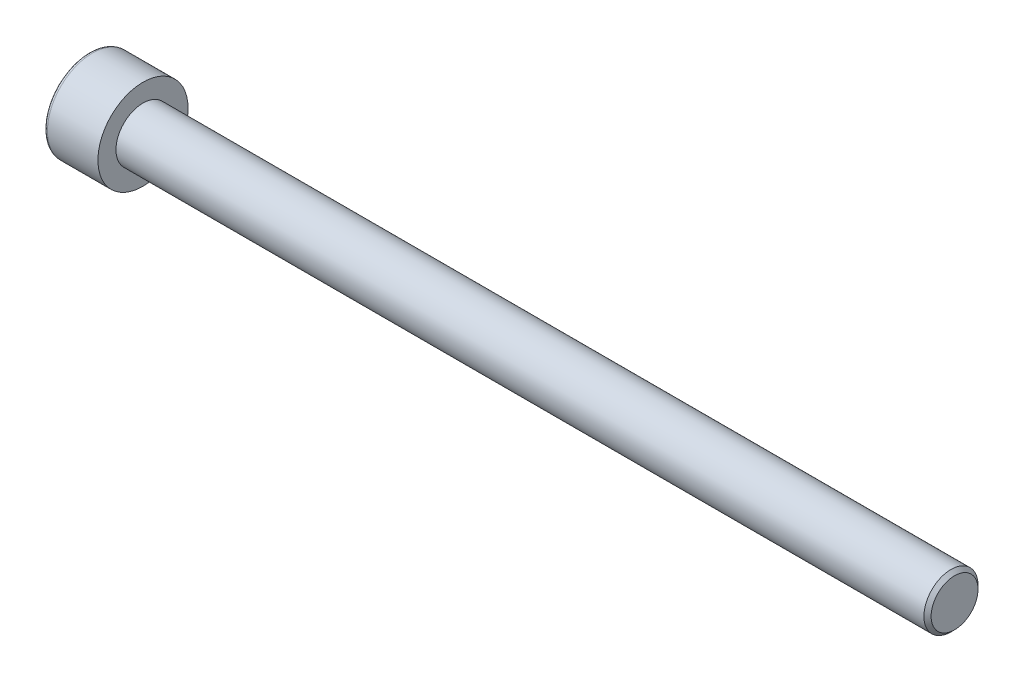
ISO-10303-21;
HEADER;
FILE_DESCRIPTION(('STEP AP214'),'2;1');
FILE_NAME('part.step','',(''),(''),'','','');
FILE_SCHEMA(('AUTOMOTIVE_DESIGN { 1 0 10303 214 1 1 1 1 }'));
ENDSEC;
DATA;
#1=APPLICATION_CONTEXT('core data for automotive mechanical design processes');
#2=APPLICATION_PROTOCOL_DEFINITION('international standard','automotive_design',2000,#1);
#3=PRODUCT_CONTEXT('',#1,'mechanical');
#4=PRODUCT('Part','Part','',(#3));
#5=PRODUCT_RELATED_PRODUCT_CATEGORY('part','',(#4));
#6=PRODUCT_DEFINITION_FORMATION('','',#4);
#7=PRODUCT_DEFINITION_CONTEXT('part definition',#1,'design');
#8=PRODUCT_DEFINITION('design','',#6,#7);
#9=PRODUCT_DEFINITION_SHAPE('','',#8);
#10=(LENGTH_UNIT() NAMED_UNIT(*) SI_UNIT(.MILLI.,.METRE.));
#11=(NAMED_UNIT(*) PLANE_ANGLE_UNIT() SI_UNIT($,.RADIAN.));
#12=(NAMED_UNIT(*) SI_UNIT($,.STERADIAN.) SOLID_ANGLE_UNIT());
#13=UNCERTAINTY_MEASURE_WITH_UNIT(LENGTH_MEASURE(1.E-05),#10,'distance_accuracy_value','');
#14=(GEOMETRIC_REPRESENTATION_CONTEXT(3) GLOBAL_UNCERTAINTY_ASSIGNED_CONTEXT((#13)) GLOBAL_UNIT_ASSIGNED_CONTEXT((#10,
#11,#12)) REPRESENTATION_CONTEXT('',''));
#15=CARTESIAN_POINT('',(0.,0.,0.));
#16=DIRECTION('',(0.,0.,1.));
#17=DIRECTION('',(1.,0.,0.));
#18=AXIS2_PLACEMENT_3D('',#15,#16,#17);
#19=CARTESIAN_POINT('',(0.,0.,0.));
#20=DIRECTION('',(1.,0.,0.));
#21=DIRECTION('',(0.,0.,-1.));
#22=AXIS2_PLACEMENT_3D('',#19,#20,#21);
#23=PLANE('',#22);
#24=CARTESIAN_POINT('',(0.,0.,0.));
#25=DIRECTION('',(1.,0.,0.));
#26=DIRECTION('',(0.,0.,-1.));
#27=AXIS2_PLACEMENT_3D('',#24,#25,#26);
#28=CIRCLE('',#27,5.);
#29=CARTESIAN_POINT('',(0.,0.,-5.));
#30=VERTEX_POINT('',#29);
#31=EDGE_CURVE('E225',#30,#30,#28,.T.);
#32=ORIENTED_EDGE('',*,*,#31,.T.);
#33=EDGE_LOOP('',(#32));
#34=FACE_BOUND('',#33,.T.);
#35=CARTESIAN_POINT('',(0.,0.,0.));
#36=DIRECTION('',(1.,0.,0.));
#37=DIRECTION('',(0.,0.,-1.));
#38=AXIS2_PLACEMENT_3D('',#35,#36,#37);
#39=CIRCLE('',#38,3.);
#40=CARTESIAN_POINT('',(0.,0.,-3.));
#41=VERTEX_POINT('',#40);
#42=EDGE_CURVE('E222',#41,#41,#39,.T.);
#43=ORIENTED_EDGE('',*,*,#42,.F.);
#44=EDGE_LOOP('',(#43));
#45=FACE_BOUND('',#44,.T.);
#46=ADVANCED_FACE('F17',(#34,#45),#23,.T.);
#47=CARTESIAN_POINT('',(-6.,0.,0.));
#48=DIRECTION('',(1.,0.,0.));
#49=DIRECTION('',(0.,0.,-1.));
#50=AXIS2_PLACEMENT_3D('',#47,#48,#49);
#51=CYLINDRICAL_SURFACE('',#50,5.);
#52=CARTESIAN_POINT('',(-5.6,0.,0.));
#53=DIRECTION('',(1.,0.,0.));
#54=DIRECTION('',(0.,0.,-1.));
#55=AXIS2_PLACEMENT_3D('',#52,#53,#54);
#56=CIRCLE('',#55,5.);
#57=CARTESIAN_POINT('',(-5.6,0.,-5.));
#58=VERTEX_POINT('',#57);
#59=EDGE_CURVE('E233',#58,#58,#56,.T.);
#60=ORIENTED_EDGE('',*,*,#59,.T.);
#61=EDGE_LOOP('',(#60));
#62=FACE_BOUND('',#61,.T.);
#63=ORIENTED_EDGE('',*,*,#31,.F.);
#64=EDGE_LOOP('',(#63));
#65=FACE_BOUND('',#64,.T.);
#66=ADVANCED_FACE('F19',(#62,#65),#51,.T.);
#67=CARTESIAN_POINT('',(-6.,0.,0.));
#68=DIRECTION('',(1.,0.,0.));
#69=DIRECTION('',(0.,0.,-1.));
#70=AXIS2_PLACEMENT_3D('',#67,#68,#69);
#71=PLANE('',#70);
#72=CARTESIAN_POINT('',(-6.,0.,0.));
#73=DIRECTION('',(1.,0.,0.));
#74=DIRECTION('',(0.,0.,-1.));
#75=AXIS2_PLACEMENT_3D('',#72,#73,#74);
#76=CIRCLE('',#75,4.6);
#77=CARTESIAN_POINT('',(-6.,0.,-4.6));
#78=VERTEX_POINT('',#77);
#79=EDGE_CURVE('E30',#78,#78,#76,.F.);
#80=ORIENTED_EDGE('',*,*,#79,.T.);
#81=EDGE_LOOP('',(#80));
#82=FACE_BOUND('',#81,.T.);
#83=CARTESIAN_POINT('',(-6.,0.,0.));
#84=DIRECTION('',(-1.,0.,0.));
#85=DIRECTION('',(0.,0.,1.));
#86=AXIS2_PLACEMENT_3D('',#83,#84,#85);
#87=CIRCLE('',#86,2.88675134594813);
#88=CARTESIAN_POINT('',(-6.,1.44337567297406,-2.5));
#89=VERTEX_POINT('',#88);
#90=CARTESIAN_POINT('',(-6.,-1.44337567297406,-2.5));
#91=VERTEX_POINT('',#90);
#92=EDGE_CURVE('E186',#89,#91,#87,.T.);
#93=ORIENTED_EDGE('',*,*,#92,.F.);
#94=CARTESIAN_POINT('',(-6.,2.88675134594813,0.));
#95=VERTEX_POINT('',#94);
#96=EDGE_CURVE('E91',#95,#89,#87,.T.);
#97=ORIENTED_EDGE('',*,*,#96,.F.);
#98=CARTESIAN_POINT('',(-6.,1.44337567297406,2.5));
#99=VERTEX_POINT('',#98);
#100=EDGE_CURVE('E36',#99,#95,#87,.T.);
#101=ORIENTED_EDGE('',*,*,#100,.F.);
#102=CARTESIAN_POINT('',(-6.,-1.44337567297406,2.5));
#103=VERTEX_POINT('',#102);
#104=EDGE_CURVE('E43',#103,#99,#87,.T.);
#105=ORIENTED_EDGE('',*,*,#104,.F.);
#106=CARTESIAN_POINT('',(-6.,-2.88675134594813,0.));
#107=VERTEX_POINT('',#106);
#108=EDGE_CURVE('E87',#107,#103,#87,.T.);
#109=ORIENTED_EDGE('',*,*,#108,.F.);
#110=EDGE_CURVE('E189',#91,#107,#87,.T.);
#111=ORIENTED_EDGE('',*,*,#110,.F.);
#112=EDGE_LOOP('',(#93,#97,#101,#105,#109,#111));
#113=FACE_BOUND('',#112,.T.);
#114=ADVANCED_FACE('F165',(#82,#113),#71,.F.);
#115=CARTESIAN_POINT('',(90.,0.,0.));
#116=DIRECTION('',(-1.,0.,0.));
#117=DIRECTION('',(0.,0.,1.));
#118=AXIS2_PLACEMENT_3D('',#115,#116,#117);
#119=CYLINDRICAL_SURFACE('',#118,3.);
#120=CARTESIAN_POINT('',(89.6,0.,0.));
#121=DIRECTION('',(1.,0.,0.));
#122=DIRECTION('',(0.,0.,-1.));
#123=AXIS2_PLACEMENT_3D('',#120,#121,#122);
#124=CIRCLE('',#123,3.);
#125=CARTESIAN_POINT('',(89.6,0.,-3.));
#126=VERTEX_POINT('',#125);
#127=EDGE_CURVE('E230',#126,#126,#124,.F.);
#128=ORIENTED_EDGE('',*,*,#127,.T.);
#129=EDGE_LOOP('',(#128));
#130=FACE_BOUND('',#129,.T.);
#131=ORIENTED_EDGE('',*,*,#42,.T.);
#132=EDGE_LOOP('',(#131));
#133=FACE_BOUND('',#132,.T.);
#134=ADVANCED_FACE('F170',(#130,#133),#119,.T.);
#135=CARTESIAN_POINT('',(90.,0.,0.));
#136=DIRECTION('',(1.,0.,0.));
#137=DIRECTION('',(0.,0.,-1.));
#138=AXIS2_PLACEMENT_3D('',#135,#136,#137);
#139=PLANE('',#138);
#140=CARTESIAN_POINT('',(90.,0.,0.));
#141=DIRECTION('',(1.,0.,0.));
#142=DIRECTION('',(0.,0.,-1.));
#143=AXIS2_PLACEMENT_3D('',#140,#141,#142);
#144=CIRCLE('',#143,2.6);
#145=CARTESIAN_POINT('',(90.,0.,-2.6));
#146=VERTEX_POINT('',#145);
#147=EDGE_CURVE('E227',#146,#146,#144,.T.);
#148=ORIENTED_EDGE('',*,*,#147,.T.);
#149=EDGE_LOOP('',(#148));
#150=FACE_BOUND('',#149,.T.);
#151=ADVANCED_FACE('F177',(#150),#139,.T.);
#152=CARTESIAN_POINT('',(90.,0.,0.));
#153=DIRECTION('',(-1.,0.,0.));
#154=DIRECTION('',(0.,0.,1.));
#155=AXIS2_PLACEMENT_3D('',#152,#153,#154);
#156=CONICAL_SURFACE('',#155,2.6,0.785398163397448);
#157=ORIENTED_EDGE('',*,*,#127,.F.);
#158=EDGE_LOOP('',(#157));
#159=FACE_BOUND('',#158,.T.);
#160=ORIENTED_EDGE('',*,*,#147,.F.);
#161=EDGE_LOOP('',(#160));
#162=FACE_BOUND('',#161,.T.);
#163=ADVANCED_FACE('F239',(#159,#162),#156,.T.);
#164=CARTESIAN_POINT('',(-5.6,0.,0.));
#165=DIRECTION('',(1.,0.,0.));
#166=DIRECTION('',(0.,0.,-1.));
#167=AXIS2_PLACEMENT_3D('',#164,#165,#166);
#168=TOROIDAL_SURFACE('',#167,4.6,0.4);
#169=ORIENTED_EDGE('',*,*,#79,.F.);
#170=EDGE_LOOP('',(#169));
#171=FACE_BOUND('',#170,.T.);
#172=ORIENTED_EDGE('',*,*,#59,.F.);
#173=EDGE_LOOP('',(#172));
#174=FACE_BOUND('',#173,.T.);
#175=ADVANCED_FACE('F115',(#171,#174),#168,.T.);
#176=CARTESIAN_POINT('',(-6.,0.,0.));
#177=DIRECTION('',(-1.,0.,0.));
#178=DIRECTION('',(0.,0.,1.));
#179=AXIS2_PLACEMENT_3D('',#176,#177,#178);
#180=CONICAL_SURFACE('',#179,2.88675134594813,0.785398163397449);
#181=ORIENTED_EDGE('',*,*,#92,.T.);
#182=CARTESIAN_POINT('',(-6.84474007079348,-2.77020363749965,-2.5));
#183=CARTESIAN_POINT('',(-6.79429722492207,-2.70224105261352,-2.5));
#184=CARTESIAN_POINT('',(-6.74437428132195,-2.63388631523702,-2.5));
#185=CARTESIAN_POINT('',(-6.6457965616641,-2.49624219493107,-2.5));
#186=CARTESIAN_POINT('',(-6.59714212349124,-2.42695257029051,-2.5));
#187=CARTESIAN_POINT('',(-6.50098521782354,-2.28678261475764,-2.5));
#188=CARTESIAN_POINT('',(-6.45349461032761,-2.21589411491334,-2.5));
#189=CARTESIAN_POINT('',(-6.36039504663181,-2.07289801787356,-2.5));
#190=CARTESIAN_POINT('',(-6.31478595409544,-2.00079050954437,-2.5));
#191=CARTESIAN_POINT('',(-6.22353453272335,-1.85136748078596,-2.5));
#192=CARTESIAN_POINT('',(-6.17801448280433,-1.77397645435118,-2.5));
#193=CARTESIAN_POINT('',(-6.09013743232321,-1.61742301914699,-2.5));
#194=CARTESIAN_POINT('',(-6.04778097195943,-1.53826031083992,-2.5));
#195=CARTESIAN_POINT('',(-5.92683684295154,-1.29823189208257,-2.5));
#196=CARTESIAN_POINT('',(-5.85401661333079,-1.1342610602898,-2.5));
#197=CARTESIAN_POINT('',(-5.76496495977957,-0.887111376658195,-2.5));
#198=CARTESIAN_POINT('',(-5.73923498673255,-0.807344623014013,-2.5));
#199=CARTESIAN_POINT('',(-5.69419468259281,-0.645977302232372,-2.5));
#200=CARTESIAN_POINT('',(-5.67488482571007,-0.564376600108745,-2.5));
#201=CARTESIAN_POINT('',(-5.64398238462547,-0.401145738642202,-2.5));
#202=CARTESIAN_POINT('',(-5.63226395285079,-0.319539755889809,-2.5));
#203=CARTESIAN_POINT('',(-5.61675591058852,-0.155573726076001,-2.5));
#204=CARTESIAN_POINT('',(-5.61296514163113,-0.0732137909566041,-2.5));
#205=CARTESIAN_POINT('',(-5.61355627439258,0.0889406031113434,-2.5));
#206=CARTESIAN_POINT('',(-5.61769048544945,0.168736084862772,-2.5));
#207=CARTESIAN_POINT('',(-5.63338028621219,0.327588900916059,-2.5));
#208=CARTESIAN_POINT('',(-5.64493662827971,0.406646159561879,-2.5));
#209=CARTESIAN_POINT('',(-5.67505484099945,0.564788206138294,-2.5));
#210=CARTESIAN_POINT('',(-5.69373233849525,0.643850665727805,-2.5));
#211=CARTESIAN_POINT('',(-5.73713308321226,0.800257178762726,-2.5));
#212=CARTESIAN_POINT('',(-5.76185569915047,0.877601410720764,-2.5));
#213=CARTESIAN_POINT('',(-5.8505231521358,1.12635295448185,-2.5));
#214=CARTESIAN_POINT('',(-5.92477831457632,1.29410071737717,-2.5));
#215=CARTESIAN_POINT('',(-6.04840793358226,1.53952732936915,-2.5));
#216=CARTESIAN_POINT('',(-6.09175812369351,1.62045951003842,-2.5));
#217=CARTESIAN_POINT('',(-6.18175198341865,1.78047621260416,-2.5));
#218=CARTESIAN_POINT('',(-6.22839504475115,1.85956107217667,-2.5));
#219=CARTESIAN_POINT('',(-6.32189053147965,2.0121708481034,-2.5));
#220=CARTESIAN_POINT('',(-6.3686145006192,2.0857753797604,-2.5));
#221=CARTESIAN_POINT('',(-6.46400118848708,2.23172390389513,-2.5));
#222=CARTESIAN_POINT('',(-6.51266405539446,2.3040677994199,-2.5));
#223=CARTESIAN_POINT('',(-6.61117183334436,2.44706675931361,-2.5));
#224=CARTESIAN_POINT('',(-6.66100374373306,2.51773081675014,-2.5));
#225=CARTESIAN_POINT('',(-6.76196495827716,2.6580976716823,-2.5));
#226=CARTESIAN_POINT('',(-6.81309390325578,2.72780072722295,-2.5));
#227=CARTESIAN_POINT('',(-6.86475257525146,2.79710237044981,-2.5));
#228=B_SPLINE_CURVE_WITH_KNOTS('',3,(#182,#183,#184,#185,#186,#187,#188,#189,#190,#191,#192,
#193,#194,#195,#196,#197,#198,#199,#200,#201,#202,#203,#204,#205,#206,#207,#208,#209,#210,#211,
#212,#213,#214,#215,#216,#217,#218,#219,#220,#221,#222,#223,#224,#225,#226,#227),.UNSPECIFIED.,
.F.,.F.,(4,2,2,2,2,2,2,2,2,2,2,2,2,2,2,2,2,2,2,2,2,2,4),(0.,0.253915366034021,0.507897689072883,
0.763849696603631,1.01978312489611,1.28906200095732,1.55838675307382,2.09503555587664,
2.34626885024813,2.59752069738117,2.84449291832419,3.09142904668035,3.33077296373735,
3.57014114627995,3.81357397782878,4.0569813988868,4.60559640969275,4.88100918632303,
5.15637121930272,5.41788736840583,5.67942354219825,5.93881039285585,6.19812618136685),.UNSPECIFIED.);
#229=EDGE_CURVE('E11',#89,#91,#228,.F.);
#230=ORIENTED_EDGE('',*,*,#229,.F.);
#231=EDGE_LOOP('',(#181,#230));
#232=FACE_BOUND('',#231,.T.);
#233=ADVANCED_FACE('F113',(#232),#180,.F.);
#234=ORIENTED_EDGE('',*,*,#110,.T.);
#235=CARTESIAN_POINT('',(-6.00011547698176,-1.44326020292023,-2.5002));
#236=CARTESIAN_POINT('',(-5.95054070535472,-1.49287669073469,-2.41426172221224));
#237=CARTESIAN_POINT('',(-5.9038774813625,-1.5433228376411,-2.32688643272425));
#238=CARTESIAN_POINT('',(-5.8184381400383,-1.64618811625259,-2.14871854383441));
#239=CARTESIAN_POINT('',(-5.779709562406,-1.6986170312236,-2.05790899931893));
#240=CARTESIAN_POINT('',(-5.71336670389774,-1.80433744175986,-1.87479587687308));
#241=CARTESIAN_POINT('',(-5.68558566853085,-1.85760201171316,-1.78253893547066));
#242=CARTESIAN_POINT('',(-5.64278317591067,-1.96530378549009,-1.59599399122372));
#243=CARTESIAN_POINT('',(-5.62772976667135,-2.01973769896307,-1.50171168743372));
#244=CARTESIAN_POINT('',(-5.61414772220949,-2.11355131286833,-1.33922174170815));
#245=CARTESIAN_POINT('',(-5.6121370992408,-2.15280980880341,-1.27122403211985));
#246=CARTESIAN_POINT('',(-5.61552411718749,-2.23126263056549,-1.13533975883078));
#247=CARTESIAN_POINT('',(-5.62092435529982,-2.27045692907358,-1.06745324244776));
#248=CARTESIAN_POINT('',(-5.63882578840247,-2.34847544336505,-0.932321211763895));
#249=CARTESIAN_POINT('',(-5.65133492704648,-2.38729919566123,-0.865076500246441));
#250=CARTESIAN_POINT('',(-5.68276750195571,-2.46427534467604,-0.731749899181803));
#251=CARTESIAN_POINT('',(-5.70169044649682,-2.50242779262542,-0.665667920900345));
#252=CARTESIAN_POINT('',(-5.75786736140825,-2.60015256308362,-0.496403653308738));
#253=CARTESIAN_POINT('',(-5.79935583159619,-2.65911894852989,-0.394270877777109));
#254=CARTESIAN_POINT('',(-5.86939404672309,-2.74582384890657,-0.244093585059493));
#255=CARTESIAN_POINT('',(-5.89400225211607,-2.77439698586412,-0.194603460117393));
#256=CARTESIAN_POINT('',(-5.94546188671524,-2.83101398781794,-0.0965399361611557));
#257=CARTESIAN_POINT('',(-5.97231193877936,-2.85905816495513,-0.0479659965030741));
#258=CARTESIAN_POINT('',(-6.00011547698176,-2.88686681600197,0.000199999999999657));
#259=B_SPLINE_CURVE_WITH_KNOTS('',3,(#235,#236,#237,#238,#239,#240,#241,#242,#243,#244,#245,
#246,#247,#248,#249,#250,#251,#252,#253,#254,#255,#256,#257,#258),.UNSPECIFIED.,.F.,.F.,(4,2,2,
2,2,2,2,2,2,2,2,4),(0.,0.333012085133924,0.667964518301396,0.997597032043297,1.32639954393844,
1.56169424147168,1.79707142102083,2.0327121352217,2.2683347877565,2.64260240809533,
2.82922877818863,3.01574133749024),.UNSPECIFIED.);
#260=EDGE_CURVE('E90',#91,#107,#259,.T.);
#261=ORIENTED_EDGE('',*,*,#260,.F.);
#262=EDGE_LOOP('',(#234,#261));
#263=FACE_BOUND('',#262,.T.);
#264=ADVANCED_FACE('F244',(#263),#180,.F.);
#265=ORIENTED_EDGE('',*,*,#108,.T.);
#266=CARTESIAN_POINT('',(-6.00011547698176,-2.88686681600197,-0.000199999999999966));
#267=CARTESIAN_POINT('',(-5.95054070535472,-2.83725032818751,0.0857382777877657));
#268=CARTESIAN_POINT('',(-5.9038774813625,-2.78680418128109,0.173113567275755));
#269=CARTESIAN_POINT('',(-5.8184381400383,-2.6839389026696,0.35128145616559));
#270=CARTESIAN_POINT('',(-5.779709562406,-2.6315099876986,0.442091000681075));
#271=CARTESIAN_POINT('',(-5.71336670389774,-2.52578957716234,0.62520412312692));
#272=CARTESIAN_POINT('',(-5.68558566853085,-2.47252500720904,0.717461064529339));
#273=CARTESIAN_POINT('',(-5.64278317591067,-2.3648232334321,0.904006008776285));
#274=CARTESIAN_POINT('',(-5.62772976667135,-2.31038931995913,0.998288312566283));
#275=CARTESIAN_POINT('',(-5.61414772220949,-2.21657570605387,1.16077825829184));
#276=CARTESIAN_POINT('',(-5.6121370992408,-2.17731721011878,1.22877596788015));
#277=CARTESIAN_POINT('',(-5.61552411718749,-2.0988643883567,1.36466024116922));
#278=CARTESIAN_POINT('',(-5.62092435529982,-2.05967008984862,1.43254675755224));
#279=CARTESIAN_POINT('',(-5.63882578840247,-1.98165157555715,1.5676787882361));
#280=CARTESIAN_POINT('',(-5.65133492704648,-1.94282782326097,1.63492349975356));
#281=CARTESIAN_POINT('',(-5.68276750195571,-1.86585167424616,1.7682501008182));
#282=CARTESIAN_POINT('',(-5.70169044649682,-1.82769922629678,1.83433207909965));
#283=CARTESIAN_POINT('',(-5.75786736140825,-1.72997445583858,2.00359634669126));
#284=CARTESIAN_POINT('',(-5.79935583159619,-1.67100807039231,2.10572912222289));
#285=CARTESIAN_POINT('',(-5.86939404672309,-1.58430317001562,2.25590641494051));
#286=CARTESIAN_POINT('',(-5.89400225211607,-1.55573003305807,2.30539653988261));
#287=CARTESIAN_POINT('',(-5.94546188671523,-1.49911303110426,2.40346006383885));
#288=CARTESIAN_POINT('',(-5.97231193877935,-1.47106885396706,2.45203400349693));
#289=CARTESIAN_POINT('',(-6.00011547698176,-1.44326020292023,2.5002));
#290=B_SPLINE_CURVE_WITH_KNOTS('',3,(#266,#267,#268,#269,#270,#271,#272,#273,#274,#275,#276,
#277,#278,#279,#280,#281,#282,#283,#284,#285,#286,#287,#288,#289),.UNSPECIFIED.,.F.,.F.,(4,2,2,
2,2,2,2,2,2,2,2,4),(0.,0.333012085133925,0.667964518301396,0.997597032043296,1.32639954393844,
1.56169424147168,1.79707142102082,2.0327121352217,2.2683347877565,2.64260240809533,
2.82922877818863,3.01574133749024),.UNSPECIFIED.);
#291=EDGE_CURVE('E98',#107,#103,#290,.T.);
#292=ORIENTED_EDGE('',*,*,#291,.F.);
#293=EDGE_LOOP('',(#265,#292));
#294=FACE_BOUND('',#293,.T.);
#295=ADVANCED_FACE('F195',(#294),#180,.F.);
#296=ORIENTED_EDGE('',*,*,#104,.T.);
#297=CARTESIAN_POINT('',(-6.84474007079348,-2.77020363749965,2.5));
#298=CARTESIAN_POINT('',(-6.79429722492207,-2.70224105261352,2.5));
#299=CARTESIAN_POINT('',(-6.74437428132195,-2.63388631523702,2.5));
#300=CARTESIAN_POINT('',(-6.6457965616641,-2.49624219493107,2.5));
#301=CARTESIAN_POINT('',(-6.59714212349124,-2.4269525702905,2.5));
#302=CARTESIAN_POINT('',(-6.50098521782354,-2.28678261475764,2.5));
#303=CARTESIAN_POINT('',(-6.45349461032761,-2.21589411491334,2.5));
#304=CARTESIAN_POINT('',(-6.36039504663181,-2.07289801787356,2.5));
#305=CARTESIAN_POINT('',(-6.31478595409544,-2.00079050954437,2.5));
#306=CARTESIAN_POINT('',(-6.22353453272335,-1.85136748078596,2.5));
#307=CARTESIAN_POINT('',(-6.17801448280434,-1.77397645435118,2.5));
#308=CARTESIAN_POINT('',(-6.09013743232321,-1.61742301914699,2.5));
#309=CARTESIAN_POINT('',(-6.04778097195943,-1.53826031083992,2.5));
#310=CARTESIAN_POINT('',(-5.92683684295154,-1.29823189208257,2.5));
#311=CARTESIAN_POINT('',(-5.85401661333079,-1.1342610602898,2.5));
#312=CARTESIAN_POINT('',(-5.76496495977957,-0.887111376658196,2.5));
#313=CARTESIAN_POINT('',(-5.73923498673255,-0.807344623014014,2.5));
#314=CARTESIAN_POINT('',(-5.69419468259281,-0.645977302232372,2.5));
#315=CARTESIAN_POINT('',(-5.67488482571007,-0.564376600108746,2.5));
#316=CARTESIAN_POINT('',(-5.64398238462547,-0.401145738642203,2.5));
#317=CARTESIAN_POINT('',(-5.63226395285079,-0.31953975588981,2.5));
#318=CARTESIAN_POINT('',(-5.61675591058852,-0.155573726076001,2.5));
#319=CARTESIAN_POINT('',(-5.61296514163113,-0.0732137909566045,2.5));
#320=CARTESIAN_POINT('',(-5.61355627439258,0.0889406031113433,2.5));
#321=CARTESIAN_POINT('',(-5.61769048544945,0.168736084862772,2.5));
#322=CARTESIAN_POINT('',(-5.63338028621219,0.327588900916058,2.5));
#323=CARTESIAN_POINT('',(-5.64493662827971,0.406646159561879,2.5));
#324=CARTESIAN_POINT('',(-5.67505484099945,0.564788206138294,2.5));
#325=CARTESIAN_POINT('',(-5.69373233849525,0.643850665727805,2.5));
#326=CARTESIAN_POINT('',(-5.73713308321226,0.800257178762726,2.5));
#327=CARTESIAN_POINT('',(-5.76185569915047,0.877601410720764,2.5));
#328=CARTESIAN_POINT('',(-5.8505231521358,1.12635295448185,2.5));
#329=CARTESIAN_POINT('',(-5.92477831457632,1.29410071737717,2.5));
#330=CARTESIAN_POINT('',(-6.04840793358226,1.53952732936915,2.5));
#331=CARTESIAN_POINT('',(-6.09175812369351,1.62045951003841,2.5));
#332=CARTESIAN_POINT('',(-6.18175198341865,1.78047621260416,2.5));
#333=CARTESIAN_POINT('',(-6.22839504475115,1.85956107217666,2.5));
#334=CARTESIAN_POINT('',(-6.32189053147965,2.01217084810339,2.5));
#335=CARTESIAN_POINT('',(-6.3686145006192,2.0857753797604,2.5));
#336=CARTESIAN_POINT('',(-6.46400118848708,2.23172390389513,2.5));
#337=CARTESIAN_POINT('',(-6.51266405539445,2.3040677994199,2.5));
#338=CARTESIAN_POINT('',(-6.61117183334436,2.44706675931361,2.5));
#339=CARTESIAN_POINT('',(-6.66100374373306,2.51773081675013,2.5));
#340=CARTESIAN_POINT('',(-6.76196495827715,2.6580976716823,2.5));
#341=CARTESIAN_POINT('',(-6.81309390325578,2.72780072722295,2.5));
#342=CARTESIAN_POINT('',(-6.86475257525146,2.79710237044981,2.5));
#343=B_SPLINE_CURVE_WITH_KNOTS('',3,(#297,#298,#299,#300,#301,#302,#303,#304,#305,#306,#307,
#308,#309,#310,#311,#312,#313,#314,#315,#316,#317,#318,#319,#320,#321,#322,#323,#324,#325,#326,
#327,#328,#329,#330,#331,#332,#333,#334,#335,#336,#337,#338,#339,#340,#341,#342),.UNSPECIFIED.,
.F.,.F.,(4,2,2,2,2,2,2,2,2,2,2,2,2,2,2,2,2,2,2,2,2,2,4),(0.,0.253915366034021,0.507897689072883,
0.763849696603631,1.01978312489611,1.28906200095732,1.55838675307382,2.09503555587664,
2.34626885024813,2.59752069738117,2.84449291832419,3.09142904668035,3.33077296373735,
3.57014114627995,3.81357397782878,4.0569813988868,4.60559640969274,4.88100918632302,
5.15637121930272,5.41788736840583,5.67942354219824,5.93881039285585,6.19812618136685),.UNSPECIFIED.);
#344=EDGE_CURVE('E123',#103,#99,#343,.T.);
#345=ORIENTED_EDGE('',*,*,#344,.F.);
#346=EDGE_LOOP('',(#296,#345));
#347=FACE_BOUND('',#346,.T.);
#348=ADVANCED_FACE('F198',(#347),#180,.F.);
#349=ORIENTED_EDGE('',*,*,#100,.T.);
#350=CARTESIAN_POINT('',(-6.00011547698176,1.44326020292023,2.5002));
#351=CARTESIAN_POINT('',(-5.95054070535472,1.49287669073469,2.41426172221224));
#352=CARTESIAN_POINT('',(-5.9038774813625,1.5433228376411,2.32688643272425));
#353=CARTESIAN_POINT('',(-5.8184381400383,1.64618811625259,2.14871854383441));
#354=CARTESIAN_POINT('',(-5.779709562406,1.6986170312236,2.05790899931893));
#355=CARTESIAN_POINT('',(-5.71336670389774,1.80433744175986,1.87479587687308));
#356=CARTESIAN_POINT('',(-5.68558566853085,1.85760201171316,1.78253893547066));
#357=CARTESIAN_POINT('',(-5.64278317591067,1.96530378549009,1.59599399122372));
#358=CARTESIAN_POINT('',(-5.62772976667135,2.01973769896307,1.50171168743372));
#359=CARTESIAN_POINT('',(-5.61414772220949,2.11355131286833,1.33922174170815));
#360=CARTESIAN_POINT('',(-5.6121370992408,2.15280980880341,1.27122403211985));
#361=CARTESIAN_POINT('',(-5.61552411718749,2.23126263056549,1.13533975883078));
#362=CARTESIAN_POINT('',(-5.62092435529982,2.27045692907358,1.06745324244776));
#363=CARTESIAN_POINT('',(-5.63882578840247,2.34847544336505,0.932321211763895));
#364=CARTESIAN_POINT('',(-5.65133492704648,2.38729919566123,0.865076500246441));
#365=CARTESIAN_POINT('',(-5.68276750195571,2.46427534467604,0.731749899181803));
#366=CARTESIAN_POINT('',(-5.70169044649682,2.50242779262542,0.665667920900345));
#367=CARTESIAN_POINT('',(-5.75786736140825,2.60015256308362,0.496403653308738));
#368=CARTESIAN_POINT('',(-5.79935583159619,2.65911894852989,0.394270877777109));
#369=CARTESIAN_POINT('',(-5.86939404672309,2.74582384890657,0.244093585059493));
#370=CARTESIAN_POINT('',(-5.89400225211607,2.77439698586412,0.194603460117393));
#371=CARTESIAN_POINT('',(-5.94546188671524,2.83101398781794,0.0965399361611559));
#372=CARTESIAN_POINT('',(-5.97231193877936,2.85905816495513,0.0479659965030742));
#373=CARTESIAN_POINT('',(-6.00011547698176,2.88686681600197,-0.000199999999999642));
#374=B_SPLINE_CURVE_WITH_KNOTS('',3,(#350,#351,#352,#353,#354,#355,#356,#357,#358,#359,#360,
#361,#362,#363,#364,#365,#366,#367,#368,#369,#370,#371,#372,#373),.UNSPECIFIED.,.F.,.F.,(4,2,2,
2,2,2,2,2,2,2,2,4),(0.,0.333012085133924,0.667964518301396,0.997597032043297,1.32639954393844,
1.56169424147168,1.79707142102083,2.0327121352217,2.2683347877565,2.64260240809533,
2.82922877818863,3.01574133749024),.UNSPECIFIED.);
#375=EDGE_CURVE('E129',#99,#95,#374,.T.);
#376=ORIENTED_EDGE('',*,*,#375,.F.);
#377=EDGE_LOOP('',(#349,#376));
#378=FACE_BOUND('',#377,.T.);
#379=ADVANCED_FACE('F111',(#378),#180,.F.);
#380=ORIENTED_EDGE('',*,*,#96,.T.);
#381=CARTESIAN_POINT('',(-6.00011547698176,2.88686681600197,0.00020000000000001));
#382=CARTESIAN_POINT('',(-5.95054070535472,2.83725032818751,-0.0857382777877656));
#383=CARTESIAN_POINT('',(-5.9038774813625,2.78680418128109,-0.173113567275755));
#384=CARTESIAN_POINT('',(-5.8184381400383,2.6839389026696,-0.35128145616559));
#385=CARTESIAN_POINT('',(-5.779709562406,2.6315099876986,-0.442091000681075));
#386=CARTESIAN_POINT('',(-5.71336670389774,2.52578957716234,-0.62520412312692));
#387=CARTESIAN_POINT('',(-5.68558566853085,2.47252500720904,-0.717461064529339));
#388=CARTESIAN_POINT('',(-5.64278317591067,2.3648232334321,-0.904006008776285));
#389=CARTESIAN_POINT('',(-5.62772976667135,2.31038931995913,-0.998288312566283));
#390=CARTESIAN_POINT('',(-5.61414772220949,2.21657570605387,-1.16077825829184));
#391=CARTESIAN_POINT('',(-5.6121370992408,2.17731721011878,-1.22877596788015));
#392=CARTESIAN_POINT('',(-5.61552411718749,2.0988643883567,-1.36466024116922));
#393=CARTESIAN_POINT('',(-5.62092435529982,2.05967008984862,-1.43254675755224));
#394=CARTESIAN_POINT('',(-5.63882578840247,1.98165157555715,-1.5676787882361));
#395=CARTESIAN_POINT('',(-5.65133492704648,1.94282782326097,-1.63492349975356));
#396=CARTESIAN_POINT('',(-5.68276750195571,1.86585167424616,-1.7682501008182));
#397=CARTESIAN_POINT('',(-5.70169044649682,1.82769922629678,-1.83433207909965));
#398=CARTESIAN_POINT('',(-5.75786736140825,1.72997445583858,-2.00359634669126));
#399=CARTESIAN_POINT('',(-5.79935583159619,1.67100807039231,-2.10572912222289));
#400=CARTESIAN_POINT('',(-5.86939404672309,1.58430317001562,-2.25590641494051));
#401=CARTESIAN_POINT('',(-5.89400225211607,1.55573003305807,-2.30539653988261));
#402=CARTESIAN_POINT('',(-5.94546188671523,1.49911303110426,-2.40346006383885));
#403=CARTESIAN_POINT('',(-5.97231193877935,1.47106885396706,-2.45203400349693));
#404=CARTESIAN_POINT('',(-6.00011547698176,1.44326020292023,-2.5002));
#405=B_SPLINE_CURVE_WITH_KNOTS('',3,(#381,#382,#383,#384,#385,#386,#387,#388,#389,#390,#391,
#392,#393,#394,#395,#396,#397,#398,#399,#400,#401,#402,#403,#404),.UNSPECIFIED.,.F.,.F.,(4,2,2,
2,2,2,2,2,2,2,2,4),(0.,0.333012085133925,0.667964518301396,0.997597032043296,1.32639954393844,
1.56169424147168,1.79707142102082,2.0327121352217,2.2683347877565,2.64260240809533,
2.82922877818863,3.01574133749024),.UNSPECIFIED.);
#406=EDGE_CURVE('E134',#95,#89,#405,.T.);
#407=ORIENTED_EDGE('',*,*,#406,.F.);
#408=EDGE_LOOP('',(#380,#407));
#409=FACE_BOUND('',#408,.T.);
#410=ADVANCED_FACE('F106',(#409),#180,.F.);
#411=CARTESIAN_POINT('',(-2.,-1.44337567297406,-2.5));
#412=DIRECTION('',(0.,0.,-1.));
#413=DIRECTION('',(-1.,0.,0.));
#414=AXIS2_PLACEMENT_3D('',#411,#412,#413);
#415=PLANE('',#414);
#416=DIRECTION('',(-1.,0.,0.));
#417=VECTOR('',#416,1.);
#418=CARTESIAN_POINT('',(-2.,1.44337567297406,-2.5));
#419=LINE('',#418,#417);
#420=CARTESIAN_POINT('',(-2.,1.44337567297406,-2.5));
#421=VERTEX_POINT('',#420);
#422=EDGE_CURVE('E219',#421,#89,#419,.T.);
#423=ORIENTED_EDGE('',*,*,#422,.T.);
#424=ORIENTED_EDGE('',*,*,#229,.T.);
#425=DIRECTION('',(-1.,0.,0.));
#426=VECTOR('',#425,1.);
#427=CARTESIAN_POINT('',(-2.,-1.44337567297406,-2.5));
#428=LINE('',#427,#426);
#429=CARTESIAN_POINT('',(-2.,-1.44337567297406,-2.5));
#430=VERTEX_POINT('',#429);
#431=EDGE_CURVE('E213',#430,#91,#428,.T.);
#432=ORIENTED_EDGE('',*,*,#431,.F.);
#433=DIRECTION('',(0.,-1.,0.));
#434=VECTOR('',#433,1.);
#435=CARTESIAN_POINT('',(-2.,-1.44337567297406,-2.5));
#436=LINE('',#435,#434);
#437=EDGE_CURVE('E267',#421,#430,#436,.T.);
#438=ORIENTED_EDGE('',*,*,#437,.F.);
#439=EDGE_LOOP('',(#423,#424,#432,#438));
#440=FACE_BOUND('',#439,.T.);
#441=ADVANCED_FACE('F110',(#440),#415,.F.);
#442=CARTESIAN_POINT('',(-2.,-2.88675134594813,0.));
#443=DIRECTION('',(0.,-0.866025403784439,-0.5));
#444=DIRECTION('',(0.,0.5,-0.866025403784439));
#445=AXIS2_PLACEMENT_3D('',#442,#443,#444);
#446=PLANE('',#445);
#447=ORIENTED_EDGE('',*,*,#431,.T.);
#448=ORIENTED_EDGE('',*,*,#260,.T.);
#449=DIRECTION('',(-1.,0.,0.));
#450=VECTOR('',#449,1.);
#451=CARTESIAN_POINT('',(-2.,-2.88675134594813,0.));
#452=LINE('',#451,#450);
#453=CARTESIAN_POINT('',(-2.,-2.88675134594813,0.));
#454=VERTEX_POINT('',#453);
#455=EDGE_CURVE('E207',#454,#107,#452,.T.);
#456=ORIENTED_EDGE('',*,*,#455,.F.);
#457=DIRECTION('',(0.,-0.5,0.866025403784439));
#458=VECTOR('',#457,1.);
#459=CARTESIAN_POINT('',(-2.,-2.88675134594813,0.));
#460=LINE('',#459,#458);
#461=EDGE_CURVE('E273',#430,#454,#460,.T.);
#462=ORIENTED_EDGE('',*,*,#461,.F.);
#463=EDGE_LOOP('',(#447,#448,#456,#462));
#464=FACE_BOUND('',#463,.T.);
#465=ADVANCED_FACE('F104',(#464),#446,.F.);
#466=CARTESIAN_POINT('',(-2.,-1.44337567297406,2.5));
#467=DIRECTION('',(0.,-0.866025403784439,0.5));
#468=DIRECTION('',(0.,-0.5,-0.866025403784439));
#469=AXIS2_PLACEMENT_3D('',#466,#467,#468);
#470=PLANE('',#469);
#471=ORIENTED_EDGE('',*,*,#455,.T.);
#472=ORIENTED_EDGE('',*,*,#291,.T.);
#473=DIRECTION('',(-1.,0.,0.));
#474=VECTOR('',#473,1.);
#475=CARTESIAN_POINT('',(-2.,-1.44337567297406,2.5));
#476=LINE('',#475,#474);
#477=CARTESIAN_POINT('',(-2.,-1.44337567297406,2.5));
#478=VERTEX_POINT('',#477);
#479=EDGE_CURVE('E204',#478,#103,#476,.T.);
#480=ORIENTED_EDGE('',*,*,#479,.F.);
#481=DIRECTION('',(0.,0.5,0.866025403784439));
#482=VECTOR('',#481,1.);
#483=CARTESIAN_POINT('',(-2.,-1.44337567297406,2.5));
#484=LINE('',#483,#482);
#485=EDGE_CURVE('E277',#454,#478,#484,.T.);
#486=ORIENTED_EDGE('',*,*,#485,.F.);
#487=EDGE_LOOP('',(#471,#472,#480,#486));
#488=FACE_BOUND('',#487,.T.);
#489=ADVANCED_FACE('F148',(#488),#470,.F.);
#490=CARTESIAN_POINT('',(-2.,1.44337567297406,2.5));
#491=DIRECTION('',(0.,0.,1.));
#492=DIRECTION('',(1.,0.,0.));
#493=AXIS2_PLACEMENT_3D('',#490,#491,#492);
#494=PLANE('',#493);
#495=ORIENTED_EDGE('',*,*,#479,.T.);
#496=ORIENTED_EDGE('',*,*,#344,.T.);
#497=DIRECTION('',(-1.,0.,0.));
#498=VECTOR('',#497,1.);
#499=CARTESIAN_POINT('',(-2.,1.44337567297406,2.5));
#500=LINE('',#499,#498);
#501=CARTESIAN_POINT('',(-2.,1.44337567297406,2.5));
#502=VERTEX_POINT('',#501);
#503=EDGE_CURVE('E209',#502,#99,#500,.T.);
#504=ORIENTED_EDGE('',*,*,#503,.F.);
#505=DIRECTION('',(0.,1.,0.));
#506=VECTOR('',#505,1.);
#507=CARTESIAN_POINT('',(-2.,1.44337567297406,2.5));
#508=LINE('',#507,#506);
#509=EDGE_CURVE('E208',#478,#502,#508,.T.);
#510=ORIENTED_EDGE('',*,*,#509,.F.);
#511=EDGE_LOOP('',(#495,#496,#504,#510));
#512=FACE_BOUND('',#511,.T.);
#513=ADVANCED_FACE('F144',(#512),#494,.F.);
#514=CARTESIAN_POINT('',(-2.,2.88675134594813,0.));
#515=DIRECTION('',(0.,0.866025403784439,0.5));
#516=DIRECTION('',(0.,-0.5,0.866025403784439));
#517=AXIS2_PLACEMENT_3D('',#514,#515,#516);
#518=PLANE('',#517);
#519=ORIENTED_EDGE('',*,*,#503,.T.);
#520=ORIENTED_EDGE('',*,*,#375,.T.);
#521=DIRECTION('',(-1.,0.,0.));
#522=VECTOR('',#521,1.);
#523=CARTESIAN_POINT('',(-2.,2.88675134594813,0.));
#524=LINE('',#523,#522);
#525=CARTESIAN_POINT('',(-2.,2.88675134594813,0.));
#526=VERTEX_POINT('',#525);
#527=EDGE_CURVE('E211',#526,#95,#524,.T.);
#528=ORIENTED_EDGE('',*,*,#527,.F.);
#529=DIRECTION('',(0.,0.5,-0.866025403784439));
#530=VECTOR('',#529,1.);
#531=CARTESIAN_POINT('',(-2.,2.88675134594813,0.));
#532=LINE('',#531,#530);
#533=EDGE_CURVE('E221',#502,#526,#532,.T.);
#534=ORIENTED_EDGE('',*,*,#533,.F.);
#535=EDGE_LOOP('',(#519,#520,#528,#534));
#536=FACE_BOUND('',#535,.T.);
#537=ADVANCED_FACE('F140',(#536),#518,.F.);
#538=CARTESIAN_POINT('',(-2.,1.44337567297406,-2.5));
#539=DIRECTION('',(0.,0.866025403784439,-0.5));
#540=DIRECTION('',(0.,0.5,0.866025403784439));
#541=AXIS2_PLACEMENT_3D('',#538,#539,#540);
#542=PLANE('',#541);
#543=ORIENTED_EDGE('',*,*,#527,.T.);
#544=ORIENTED_EDGE('',*,*,#406,.T.);
#545=ORIENTED_EDGE('',*,*,#422,.F.);
#546=DIRECTION('',(0.,-0.5,-0.866025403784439));
#547=VECTOR('',#546,1.);
#548=CARTESIAN_POINT('',(-2.,1.44337567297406,-2.5));
#549=LINE('',#548,#547);
#550=EDGE_CURVE('E271',#526,#421,#549,.T.);
#551=ORIENTED_EDGE('',*,*,#550,.F.);
#552=EDGE_LOOP('',(#543,#544,#545,#551));
#553=FACE_BOUND('',#552,.T.);
#554=ADVANCED_FACE('F143',(#553),#542,.F.);
#555=CARTESIAN_POINT('',(-2.,0.,0.));
#556=DIRECTION('',(-1.,0.,0.));
#557=DIRECTION('',(0.,0.,1.));
#558=AXIS2_PLACEMENT_3D('',#555,#556,#557);
#559=PLANE('',#558);
#560=CARTESIAN_POINT('',(-2.,0.,0.));
#561=DIRECTION('',(-1.,0.,0.));
#562=DIRECTION('',(0.,0.,1.));
#563=AXIS2_PLACEMENT_3D('',#560,#561,#562);
#564=CIRCLE('',#563,3.);
#565=CARTESIAN_POINT('',(-2.,0.,3.));
#566=VERTEX_POINT('',#565);
#567=EDGE_CURVE('E84',#566,#566,#564,.T.);
#568=ORIENTED_EDGE('',*,*,#567,.F.);
#569=EDGE_LOOP('',(#568));
#570=FACE_BOUND('',#569,.T.);
#571=ORIENTED_EDGE('',*,*,#461,.T.);
#572=ORIENTED_EDGE('',*,*,#485,.T.);
#573=ORIENTED_EDGE('',*,*,#509,.T.);
#574=ORIENTED_EDGE('',*,*,#533,.T.);
#575=ORIENTED_EDGE('',*,*,#550,.T.);
#576=ORIENTED_EDGE('',*,*,#437,.T.);
#577=EDGE_LOOP('',(#571,#572,#573,#574,#575,#576));
#578=FACE_BOUND('',#577,.T.);
#579=ADVANCED_FACE('F80',(#570,#578),#559,.F.);
#580=CARTESIAN_POINT('',(-2.,0.,0.));
#581=DIRECTION('',(-1.,0.,0.));
#582=DIRECTION('',(0.,0.,1.));
#583=AXIS2_PLACEMENT_3D('',#580,#581,#582);
#584=CONICAL_SURFACE('',#583,3.,1.0471975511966);
#585=CARTESIAN_POINT('',(-0.267949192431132,0.,0.));
#586=VERTEX_POINT('',#585);
#587=VERTEX_LOOP('',#586);
#588=FACE_BOUND('',#587,.T.);
#589=ORIENTED_EDGE('',*,*,#567,.T.);
#590=EDGE_LOOP('',(#589));
#591=FACE_BOUND('',#590,.T.);
#592=ADVANCED_FACE('F77',(#588,#591),#584,.F.);
#593=CLOSED_SHELL('',(#46,#66,#114,#134,#151,#163,#175,#233,#264,#295,#348,#379,#410,#441,#465,
#489,#513,#537,#554,#579,#592));
#594=MANIFOLD_SOLID_BREP('B1',#593);
#595=ADVANCED_BREP_SHAPE_REPRESENTATION('',(#18,#594),#14);
#596=SHAPE_DEFINITION_REPRESENTATION(#9,#595);
ENDSEC;
END-ISO-10303-21;
